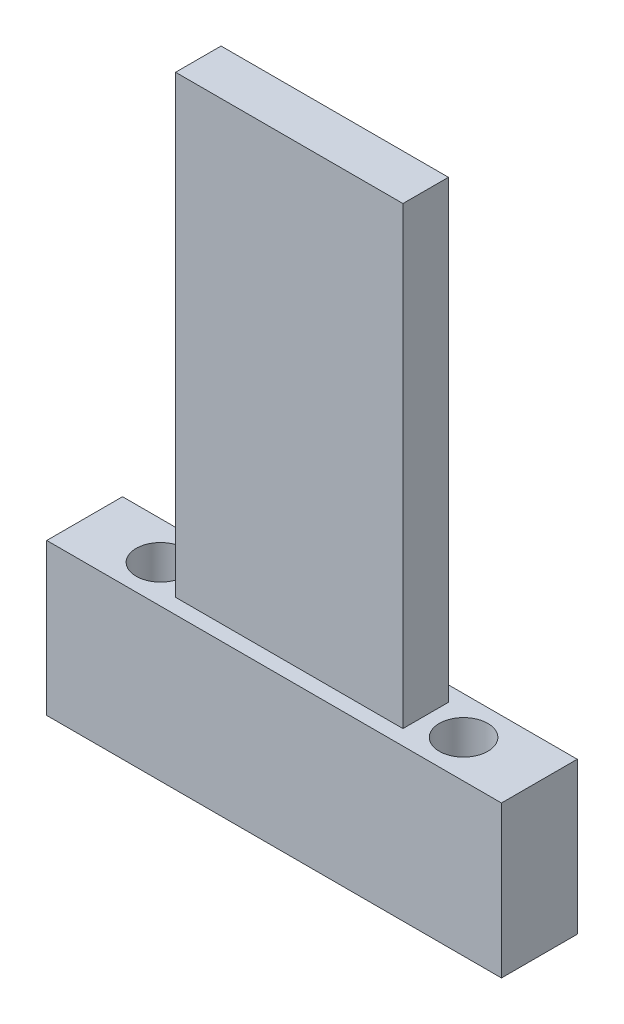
ISO-10303-21;
HEADER;
FILE_DESCRIPTION(('STEP AP214'),'2;1');
FILE_NAME('part.step','',(''),(''),'','','');
FILE_SCHEMA(('AUTOMOTIVE_DESIGN { 1 0 10303 214 1 1 1 1 }'));
ENDSEC;
DATA;
#1=APPLICATION_CONTEXT('core data for automotive mechanical design processes');
#2=APPLICATION_PROTOCOL_DEFINITION('international standard','automotive_design',2000,#1);
#3=PRODUCT_CONTEXT('',#1,'mechanical');
#4=PRODUCT('Part','Part','',(#3));
#5=PRODUCT_RELATED_PRODUCT_CATEGORY('part','',(#4));
#6=PRODUCT_DEFINITION_FORMATION('','',#4);
#7=PRODUCT_DEFINITION_CONTEXT('part definition',#1,'design');
#8=PRODUCT_DEFINITION('design','',#6,#7);
#9=PRODUCT_DEFINITION_SHAPE('','',#8);
#10=(LENGTH_UNIT() NAMED_UNIT(*) SI_UNIT(.MILLI.,.METRE.));
#11=(NAMED_UNIT(*) PLANE_ANGLE_UNIT() SI_UNIT($,.RADIAN.));
#12=(NAMED_UNIT(*) SI_UNIT($,.STERADIAN.) SOLID_ANGLE_UNIT());
#13=UNCERTAINTY_MEASURE_WITH_UNIT(LENGTH_MEASURE(1.E-05),#10,'distance_accuracy_value','');
#14=(GEOMETRIC_REPRESENTATION_CONTEXT(3) GLOBAL_UNCERTAINTY_ASSIGNED_CONTEXT((#13)) GLOBAL_UNIT_ASSIGNED_CONTEXT((#10,
#11,#12)) REPRESENTATION_CONTEXT('',''));
#15=CARTESIAN_POINT('',(0.,0.,0.));
#16=DIRECTION('',(0.,0.,1.));
#17=DIRECTION('',(1.,0.,0.));
#18=AXIS2_PLACEMENT_3D('',#15,#16,#17);
#19=CARTESIAN_POINT('',(0.,10.,0.));
#20=DIRECTION('',(0.,-1.,0.));
#21=DIRECTION('',(0.,0.,-1.));
#22=AXIS2_PLACEMENT_3D('',#19,#20,#21);
#23=PLANE('',#22);
#24=CARTESIAN_POINT('',(-10.,10.,0.));
#25=DIRECTION('',(0.,1.,0.));
#26=DIRECTION('',(0.,0.,1.));
#27=AXIS2_PLACEMENT_3D('',#24,#25,#26);
#28=CIRCLE('',#27,1.6);
#29=CARTESIAN_POINT('',(-10.,10.,1.6));
#30=VERTEX_POINT('',#29);
#31=EDGE_CURVE('E286',#30,#30,#28,.T.);
#32=ORIENTED_EDGE('',*,*,#31,.F.);
#33=EDGE_LOOP('',(#32));
#34=FACE_BOUND('',#33,.T.);
#35=CARTESIAN_POINT('',(10.,10.,0.));
#36=DIRECTION('',(0.,1.,0.));
#37=DIRECTION('',(0.,0.,-1.));
#38=AXIS2_PLACEMENT_3D('',#35,#36,#37);
#39=CIRCLE('',#38,1.6);
#40=CARTESIAN_POINT('',(10.,10.,-1.6));
#41=VERTEX_POINT('',#40);
#42=EDGE_CURVE('E291',#41,#41,#39,.T.);
#43=ORIENTED_EDGE('',*,*,#42,.F.);
#44=EDGE_LOOP('',(#43));
#45=FACE_BOUND('',#44,.T.);
#46=DIRECTION('',(0.,0.,1.));
#47=VECTOR('',#46,1.);
#48=CARTESIAN_POINT('',(-15.,10.,2.5));
#49=LINE('',#48,#47);
#50=CARTESIAN_POINT('',(-15.,10.,-2.5));
#51=VERTEX_POINT('',#50);
#52=CARTESIAN_POINT('',(-15.,10.,2.5));
#53=VERTEX_POINT('',#52);
#54=EDGE_CURVE('E127',#51,#53,#49,.T.);
#55=ORIENTED_EDGE('',*,*,#54,.T.);
#56=DIRECTION('',(1.,0.,0.));
#57=VECTOR('',#56,1.);
#58=CARTESIAN_POINT('',(-15.,10.,2.5));
#59=LINE('',#58,#57);
#60=CARTESIAN_POINT('',(15.,10.,2.5));
#61=VERTEX_POINT('',#60);
#62=EDGE_CURVE('E130',#53,#61,#59,.T.);
#63=ORIENTED_EDGE('',*,*,#62,.T.);
#64=DIRECTION('',(0.,0.,-1.));
#65=VECTOR('',#64,1.);
#66=CARTESIAN_POINT('',(15.,10.,2.5));
#67=LINE('',#66,#65);
#68=CARTESIAN_POINT('',(15.,10.,-2.5));
#69=VERTEX_POINT('',#68);
#70=EDGE_CURVE('E133',#61,#69,#67,.T.);
#71=ORIENTED_EDGE('',*,*,#70,.T.);
#72=DIRECTION('',(-1.,0.,0.));
#73=VECTOR('',#72,1.);
#74=CARTESIAN_POINT('',(-15.,10.,-2.5));
#75=LINE('',#74,#73);
#76=EDGE_CURVE('E135',#69,#51,#75,.T.);
#77=ORIENTED_EDGE('',*,*,#76,.T.);
#78=EDGE_LOOP('',(#55,#63,#71,#77));
#79=FACE_BOUND('',#78,.T.);
#80=DIRECTION('',(0.,0.,1.));
#81=VECTOR('',#80,1.);
#82=CARTESIAN_POINT('',(-7.5,10.,1.5));
#83=LINE('',#82,#81);
#84=CARTESIAN_POINT('',(-7.5,10.,-1.5));
#85=VERTEX_POINT('',#84);
#86=CARTESIAN_POINT('',(-7.5,10.,1.5));
#87=VERTEX_POINT('',#86);
#88=EDGE_CURVE('E48',#85,#87,#83,.T.);
#89=ORIENTED_EDGE('',*,*,#88,.F.);
#90=DIRECTION('',(-1.,0.,0.));
#91=VECTOR('',#90,1.);
#92=CARTESIAN_POINT('',(-7.5,10.,-1.5));
#93=LINE('',#92,#91);
#94=CARTESIAN_POINT('',(7.5,10.,-1.5));
#95=VERTEX_POINT('',#94);
#96=EDGE_CURVE('E52',#95,#85,#93,.T.);
#97=ORIENTED_EDGE('',*,*,#96,.F.);
#98=DIRECTION('',(0.,0.,-1.));
#99=VECTOR('',#98,1.);
#100=CARTESIAN_POINT('',(7.5,10.,1.5));
#101=LINE('',#100,#99);
#102=CARTESIAN_POINT('',(7.5,10.,1.5));
#103=VERTEX_POINT('',#102);
#104=EDGE_CURVE('E302',#103,#95,#101,.T.);
#105=ORIENTED_EDGE('',*,*,#104,.F.);
#106=DIRECTION('',(1.,0.,0.));
#107=VECTOR('',#106,1.);
#108=CARTESIAN_POINT('',(-7.5,10.,1.5));
#109=LINE('',#108,#107);
#110=EDGE_CURVE('E300',#87,#103,#109,.T.);
#111=ORIENTED_EDGE('',*,*,#110,.F.);
#112=EDGE_LOOP('',(#89,#97,#105,#111));
#113=FACE_BOUND('',#112,.T.);
#114=ADVANCED_FACE('F33',(#34,#45,#79,#113),#23,.F.);
#115=CARTESIAN_POINT('',(-15.,10.,2.5));
#116=DIRECTION('',(1.,0.,0.));
#117=DIRECTION('',(0.,0.,-1.));
#118=AXIS2_PLACEMENT_3D('',#115,#116,#117);
#119=PLANE('',#118);
#120=DIRECTION('',(0.,0.,1.));
#121=VECTOR('',#120,1.);
#122=CARTESIAN_POINT('',(-15.,0.,2.5));
#123=LINE('',#122,#121);
#124=CARTESIAN_POINT('',(-15.,0.,-2.5));
#125=VERTEX_POINT('',#124);
#126=CARTESIAN_POINT('',(-15.,0.,2.5));
#127=VERTEX_POINT('',#126);
#128=EDGE_CURVE('E118',#125,#127,#123,.T.);
#129=ORIENTED_EDGE('',*,*,#128,.T.);
#130=DIRECTION('',(0.,-1.,0.));
#131=VECTOR('',#130,1.);
#132=CARTESIAN_POINT('',(-15.,10.,2.5));
#133=LINE('',#132,#131);
#134=EDGE_CURVE('E11',#53,#127,#133,.T.);
#135=ORIENTED_EDGE('',*,*,#134,.F.);
#136=ORIENTED_EDGE('',*,*,#54,.F.);
#137=DIRECTION('',(0.,-1.,0.));
#138=VECTOR('',#137,1.);
#139=CARTESIAN_POINT('',(-15.,10.,-2.5));
#140=LINE('',#139,#138);
#141=EDGE_CURVE('E136',#51,#125,#140,.T.);
#142=ORIENTED_EDGE('',*,*,#141,.T.);
#143=EDGE_LOOP('',(#129,#135,#136,#142));
#144=FACE_BOUND('',#143,.T.);
#145=ADVANCED_FACE('F35',(#144),#119,.F.);
#146=CARTESIAN_POINT('',(-15.,10.,2.5));
#147=DIRECTION('',(0.,0.,-1.));
#148=DIRECTION('',(-1.,0.,0.));
#149=AXIS2_PLACEMENT_3D('',#146,#147,#148);
#150=PLANE('',#149);
#151=DIRECTION('',(1.,0.,0.));
#152=VECTOR('',#151,1.);
#153=CARTESIAN_POINT('',(-15.,0.,2.5));
#154=LINE('',#153,#152);
#155=CARTESIAN_POINT('',(15.,0.,2.5));
#156=VERTEX_POINT('',#155);
#157=EDGE_CURVE('E121',#127,#156,#154,.T.);
#158=ORIENTED_EDGE('',*,*,#157,.T.);
#159=DIRECTION('',(0.,-1.,0.));
#160=VECTOR('',#159,1.);
#161=CARTESIAN_POINT('',(15.,10.,2.5));
#162=LINE('',#161,#160);
#163=EDGE_CURVE('E41',#61,#156,#162,.T.);
#164=ORIENTED_EDGE('',*,*,#163,.F.);
#165=ORIENTED_EDGE('',*,*,#62,.F.);
#166=ORIENTED_EDGE('',*,*,#134,.T.);
#167=EDGE_LOOP('',(#158,#164,#165,#166));
#168=FACE_BOUND('',#167,.T.);
#169=ADVANCED_FACE('F166',(#168),#150,.F.);
#170=CARTESIAN_POINT('',(15.,10.,2.5));
#171=DIRECTION('',(-1.,0.,0.));
#172=DIRECTION('',(0.,0.,1.));
#173=AXIS2_PLACEMENT_3D('',#170,#171,#172);
#174=PLANE('',#173);
#175=DIRECTION('',(0.,0.,-1.));
#176=VECTOR('',#175,1.);
#177=CARTESIAN_POINT('',(15.,0.,2.5));
#178=LINE('',#177,#176);
#179=CARTESIAN_POINT('',(15.,0.,-2.5));
#180=VERTEX_POINT('',#179);
#181=EDGE_CURVE('E139',#156,#180,#178,.T.);
#182=ORIENTED_EDGE('',*,*,#181,.T.);
#183=DIRECTION('',(0.,-1.,0.));
#184=VECTOR('',#183,1.);
#185=CARTESIAN_POINT('',(15.,10.,-2.5));
#186=LINE('',#185,#184);
#187=EDGE_CURVE('E144',#69,#180,#186,.T.);
#188=ORIENTED_EDGE('',*,*,#187,.F.);
#189=ORIENTED_EDGE('',*,*,#70,.F.);
#190=ORIENTED_EDGE('',*,*,#163,.T.);
#191=EDGE_LOOP('',(#182,#188,#189,#190));
#192=FACE_BOUND('',#191,.T.);
#193=ADVANCED_FACE('F151',(#192),#174,.F.);
#194=CARTESIAN_POINT('',(-15.,10.,-2.5));
#195=DIRECTION('',(0.,0.,1.));
#196=DIRECTION('',(1.,0.,0.));
#197=AXIS2_PLACEMENT_3D('',#194,#195,#196);
#198=PLANE('',#197);
#199=DIRECTION('',(-1.,0.,0.));
#200=VECTOR('',#199,1.);
#201=CARTESIAN_POINT('',(-15.,0.,-2.5));
#202=LINE('',#201,#200);
#203=EDGE_CURVE('E131',#180,#125,#202,.T.);
#204=ORIENTED_EDGE('',*,*,#203,.T.);
#205=ORIENTED_EDGE('',*,*,#141,.F.);
#206=ORIENTED_EDGE('',*,*,#76,.F.);
#207=ORIENTED_EDGE('',*,*,#187,.T.);
#208=EDGE_LOOP('',(#204,#205,#206,#207));
#209=FACE_BOUND('',#208,.T.);
#210=ADVANCED_FACE('F160',(#209),#198,.F.);
#211=CARTESIAN_POINT('',(0.,0.,0.));
#212=DIRECTION('',(0.,-1.,0.));
#213=DIRECTION('',(0.,0.,-1.));
#214=AXIS2_PLACEMENT_3D('',#211,#212,#213);
#215=PLANE('',#214);
#216=CARTESIAN_POINT('',(-10.,0.,0.));
#217=DIRECTION('',(0.,1.,0.));
#218=DIRECTION('',(0.,0.,1.));
#219=AXIS2_PLACEMENT_3D('',#216,#217,#218);
#220=CIRCLE('',#219,1.6);
#221=CARTESIAN_POINT('',(-10.,0.,1.6));
#222=VERTEX_POINT('',#221);
#223=EDGE_CURVE('E284',#222,#222,#220,.T.);
#224=ORIENTED_EDGE('',*,*,#223,.T.);
#225=EDGE_LOOP('',(#224));
#226=FACE_BOUND('',#225,.T.);
#227=CARTESIAN_POINT('',(10.,0.,0.));
#228=DIRECTION('',(0.,1.,0.));
#229=DIRECTION('',(0.,0.,-1.));
#230=AXIS2_PLACEMENT_3D('',#227,#228,#229);
#231=CIRCLE('',#230,1.6);
#232=CARTESIAN_POINT('',(10.,0.,-1.6));
#233=VERTEX_POINT('',#232);
#234=EDGE_CURVE('E287',#233,#233,#231,.T.);
#235=ORIENTED_EDGE('',*,*,#234,.T.);
#236=EDGE_LOOP('',(#235));
#237=FACE_BOUND('',#236,.T.);
#238=ORIENTED_EDGE('',*,*,#128,.F.);
#239=ORIENTED_EDGE('',*,*,#203,.F.);
#240=ORIENTED_EDGE('',*,*,#181,.F.);
#241=ORIENTED_EDGE('',*,*,#157,.F.);
#242=EDGE_LOOP('',(#238,#239,#240,#241));
#243=FACE_BOUND('',#242,.T.);
#244=ADVANCED_FACE('F157',(#226,#237,#243),#215,.T.);
#245=CARTESIAN_POINT('',(-7.5,40.,1.5));
#246=DIRECTION('',(1.,0.,0.));
#247=DIRECTION('',(0.,0.,-1.));
#248=AXIS2_PLACEMENT_3D('',#245,#246,#247);
#249=PLANE('',#248);
#250=ORIENTED_EDGE('',*,*,#88,.T.);
#251=DIRECTION('',(0.,-1.,0.));
#252=VECTOR('',#251,1.);
#253=CARTESIAN_POINT('',(-7.5,40.,1.5));
#254=LINE('',#253,#252);
#255=CARTESIAN_POINT('',(-7.5,40.,1.5));
#256=VERTEX_POINT('',#255);
#257=EDGE_CURVE('E101',#256,#87,#254,.T.);
#258=ORIENTED_EDGE('',*,*,#257,.F.);
#259=DIRECTION('',(0.,0.,1.));
#260=VECTOR('',#259,1.);
#261=CARTESIAN_POINT('',(-7.5,40.,1.5));
#262=LINE('',#261,#260);
#263=CARTESIAN_POINT('',(-7.5,40.,-1.5));
#264=VERTEX_POINT('',#263);
#265=EDGE_CURVE('E107',#264,#256,#262,.T.);
#266=ORIENTED_EDGE('',*,*,#265,.F.);
#267=DIRECTION('',(0.,-1.,0.));
#268=VECTOR('',#267,1.);
#269=CARTESIAN_POINT('',(-7.5,40.,-1.5));
#270=LINE('',#269,#268);
#271=EDGE_CURVE('E298',#264,#85,#270,.T.);
#272=ORIENTED_EDGE('',*,*,#271,.T.);
#273=EDGE_LOOP('',(#250,#258,#266,#272));
#274=FACE_BOUND('',#273,.T.);
#275=ADVANCED_FACE('F117',(#274),#249,.F.);
#276=CARTESIAN_POINT('',(-7.5,40.,1.5));
#277=DIRECTION('',(0.,0.,-1.));
#278=DIRECTION('',(-1.,0.,0.));
#279=AXIS2_PLACEMENT_3D('',#276,#277,#278);
#280=PLANE('',#279);
#281=ORIENTED_EDGE('',*,*,#110,.T.);
#282=DIRECTION('',(0.,-1.,0.));
#283=VECTOR('',#282,1.);
#284=CARTESIAN_POINT('',(7.5,40.,1.5));
#285=LINE('',#284,#283);
#286=CARTESIAN_POINT('',(7.5,40.,1.5));
#287=VERTEX_POINT('',#286);
#288=EDGE_CURVE('E103',#287,#103,#285,.T.);
#289=ORIENTED_EDGE('',*,*,#288,.F.);
#290=DIRECTION('',(1.,0.,0.));
#291=VECTOR('',#290,1.);
#292=CARTESIAN_POINT('',(-7.5,40.,1.5));
#293=LINE('',#292,#291);
#294=EDGE_CURVE('E96',#256,#287,#293,.T.);
#295=ORIENTED_EDGE('',*,*,#294,.F.);
#296=ORIENTED_EDGE('',*,*,#257,.T.);
#297=EDGE_LOOP('',(#281,#289,#295,#296));
#298=FACE_BOUND('',#297,.T.);
#299=ADVANCED_FACE('F99',(#298),#280,.F.);
#300=CARTESIAN_POINT('',(7.5,40.,1.5));
#301=DIRECTION('',(-1.,0.,0.));
#302=DIRECTION('',(0.,0.,1.));
#303=AXIS2_PLACEMENT_3D('',#300,#301,#302);
#304=PLANE('',#303);
#305=ORIENTED_EDGE('',*,*,#104,.T.);
#306=DIRECTION('',(0.,-1.,0.));
#307=VECTOR('',#306,1.);
#308=CARTESIAN_POINT('',(7.5,40.,-1.5));
#309=LINE('',#308,#307);
#310=CARTESIAN_POINT('',(7.5,40.,-1.5));
#311=VERTEX_POINT('',#310);
#312=EDGE_CURVE('E123',#311,#95,#309,.T.);
#313=ORIENTED_EDGE('',*,*,#312,.F.);
#314=DIRECTION('',(0.,0.,-1.));
#315=VECTOR('',#314,1.);
#316=CARTESIAN_POINT('',(7.5,40.,1.5));
#317=LINE('',#316,#315);
#318=EDGE_CURVE('E106',#287,#311,#317,.T.);
#319=ORIENTED_EDGE('',*,*,#318,.F.);
#320=ORIENTED_EDGE('',*,*,#288,.T.);
#321=EDGE_LOOP('',(#305,#313,#319,#320));
#322=FACE_BOUND('',#321,.T.);
#323=ADVANCED_FACE('F207',(#322),#304,.F.);
#324=CARTESIAN_POINT('',(-7.5,40.,-1.5));
#325=DIRECTION('',(0.,0.,1.));
#326=DIRECTION('',(1.,0.,0.));
#327=AXIS2_PLACEMENT_3D('',#324,#325,#326);
#328=PLANE('',#327);
#329=ORIENTED_EDGE('',*,*,#96,.T.);
#330=ORIENTED_EDGE('',*,*,#271,.F.);
#331=DIRECTION('',(-1.,0.,0.));
#332=VECTOR('',#331,1.);
#333=CARTESIAN_POINT('',(-7.5,40.,-1.5));
#334=LINE('',#333,#332);
#335=EDGE_CURVE('E112',#311,#264,#334,.T.);
#336=ORIENTED_EDGE('',*,*,#335,.F.);
#337=ORIENTED_EDGE('',*,*,#312,.T.);
#338=EDGE_LOOP('',(#329,#330,#336,#337));
#339=FACE_BOUND('',#338,.T.);
#340=ADVANCED_FACE('F213',(#339),#328,.F.);
#341=CARTESIAN_POINT('',(0.,40.,0.));
#342=DIRECTION('',(0.,-1.,0.));
#343=DIRECTION('',(0.,0.,-1.));
#344=AXIS2_PLACEMENT_3D('',#341,#342,#343);
#345=PLANE('',#344);
#346=ORIENTED_EDGE('',*,*,#265,.T.);
#347=ORIENTED_EDGE('',*,*,#294,.T.);
#348=ORIENTED_EDGE('',*,*,#318,.T.);
#349=ORIENTED_EDGE('',*,*,#335,.T.);
#350=EDGE_LOOP('',(#346,#347,#348,#349));
#351=FACE_BOUND('',#350,.T.);
#352=ADVANCED_FACE('F110',(#351),#345,.F.);
#353=CARTESIAN_POINT('',(10.,0.,0.));
#354=DIRECTION('',(0.,1.,0.));
#355=DIRECTION('',(0.,0.,1.));
#356=AXIS2_PLACEMENT_3D('',#353,#354,#355);
#357=CYLINDRICAL_SURFACE('',#356,1.6);
#358=ORIENTED_EDGE('',*,*,#234,.F.);
#359=EDGE_LOOP('',(#358));
#360=FACE_BOUND('',#359,.T.);
#361=ORIENTED_EDGE('',*,*,#42,.T.);
#362=EDGE_LOOP('',(#361));
#363=FACE_BOUND('',#362,.T.);
#364=ADVANCED_FACE('F228',(#360,#363),#357,.F.);
#365=CARTESIAN_POINT('',(-10.,0.,0.));
#366=DIRECTION('',(0.,1.,0.));
#367=DIRECTION('',(0.,0.,1.));
#368=AXIS2_PLACEMENT_3D('',#365,#366,#367);
#369=CYLINDRICAL_SURFACE('',#368,1.6);
#370=ORIENTED_EDGE('',*,*,#223,.F.);
#371=EDGE_LOOP('',(#370));
#372=FACE_BOUND('',#371,.T.);
#373=ORIENTED_EDGE('',*,*,#31,.T.);
#374=EDGE_LOOP('',(#373));
#375=FACE_BOUND('',#374,.T.);
#376=ADVANCED_FACE('F234',(#372,#375),#369,.F.);
#377=CLOSED_SHELL('',(#114,#145,#169,#193,#210,#244,#275,#299,#323,#340,#352,#364,#376));
#378=MANIFOLD_SOLID_BREP('B2',#377);
#379=ADVANCED_BREP_SHAPE_REPRESENTATION('',(#18,#378),#14);
#380=SHAPE_DEFINITION_REPRESENTATION(#9,#379);
ENDSEC;
END-ISO-10303-21;
